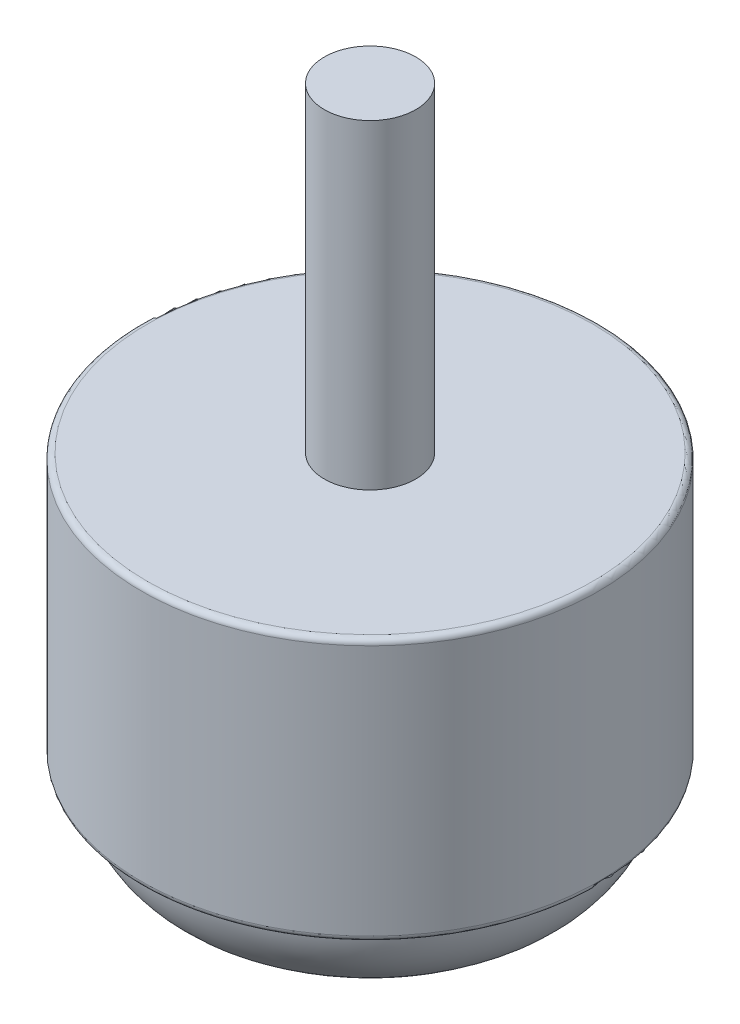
ISO-10303-21;
HEADER;
FILE_DESCRIPTION(('STEP AP214'),'2;1');
FILE_NAME('part.step','',(''),(''),'','','');
FILE_SCHEMA(('AUTOMOTIVE_DESIGN { 1 0 10303 214 1 1 1 1 }'));
ENDSEC;
DATA;
#1=APPLICATION_CONTEXT('core data for automotive mechanical design processes');
#2=APPLICATION_PROTOCOL_DEFINITION('international standard','automotive_design',2000,#1);
#3=PRODUCT_CONTEXT('',#1,'mechanical');
#4=PRODUCT('Part','Part','',(#3));
#5=PRODUCT_RELATED_PRODUCT_CATEGORY('part','',(#4));
#6=PRODUCT_DEFINITION_FORMATION('','',#4);
#7=PRODUCT_DEFINITION_CONTEXT('part definition',#1,'design');
#8=PRODUCT_DEFINITION('design','',#6,#7);
#9=PRODUCT_DEFINITION_SHAPE('','',#8);
#10=(LENGTH_UNIT() NAMED_UNIT(*) SI_UNIT(.MILLI.,.METRE.));
#11=(NAMED_UNIT(*) PLANE_ANGLE_UNIT() SI_UNIT($,.RADIAN.));
#12=(NAMED_UNIT(*) SI_UNIT($,.STERADIAN.) SOLID_ANGLE_UNIT());
#13=UNCERTAINTY_MEASURE_WITH_UNIT(LENGTH_MEASURE(1.E-05),#10,'distance_accuracy_value','');
#14=(GEOMETRIC_REPRESENTATION_CONTEXT(3) GLOBAL_UNCERTAINTY_ASSIGNED_CONTEXT((#13)) GLOBAL_UNIT_ASSIGNED_CONTEXT((#10,
#11,#12)) REPRESENTATION_CONTEXT('',''));
#15=CARTESIAN_POINT('',(0.,0.,0.));
#16=DIRECTION('',(0.,0.,1.));
#17=DIRECTION('',(1.,0.,0.));
#18=AXIS2_PLACEMENT_3D('',#15,#16,#17);
#19=CARTESIAN_POINT('',(0.,12.,0.));
#20=DIRECTION('',(0.,-1.,0.));
#21=DIRECTION('',(0.,0.,-1.));
#22=AXIS2_PLACEMENT_3D('',#19,#20,#21);
#23=TOROIDAL_SURFACE('',#22,19.1745128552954,1.);
#24=CARTESIAN_POINT('',(0.,13.,0.));
#25=DIRECTION('',(0.,-1.,0.));
#26=DIRECTION('',(0.,0.,-1.));
#27=AXIS2_PLACEMENT_3D('',#24,#25,#26);
#28=CIRCLE('',#27,19.1745128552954);
#29=CARTESIAN_POINT('',(0.,13.,-19.1745128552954));
#30=VERTEX_POINT('',#29);
#31=EDGE_CURVE('E10',#30,#30,#28,.T.);
#32=ORIENTED_EDGE('',*,*,#31,.T.);
#33=EDGE_LOOP('',(#32));
#34=FACE_BOUND('',#33,.T.);
#35=CARTESIAN_POINT('',(0.,12.1123825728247,0.));
#36=DIRECTION('',(0.,-1.,0.));
#37=DIRECTION('',(0.,0.,-1.));
#38=AXIS2_PLACEMENT_3D('',#35,#36,#37);
#39=CIRCLE('',#38,18.1808478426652);
#40=CARTESIAN_POINT('',(0.,12.1123825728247,-18.1808478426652));
#41=VERTEX_POINT('',#40);
#42=EDGE_CURVE('E67',#41,#41,#39,.T.);
#43=ORIENTED_EDGE('',*,*,#42,.F.);
#44=EDGE_LOOP('',(#43));
#45=FACE_BOUND('',#44,.T.);
#46=ADVANCED_FACE('F30',(#34,#45),#23,.F.);
#47=CARTESIAN_POINT('',(19.5,13.,0.));
#48=DIRECTION('',(0.,-1.,0.));
#49=DIRECTION('',(0.,0.,-1.));
#50=AXIS2_PLACEMENT_3D('',#47,#48,#49);
#51=PLANE('',#50);
#52=CARTESIAN_POINT('',(0.,13.,0.));
#53=DIRECTION('',(0.,-1.,0.));
#54=DIRECTION('',(0.,0.,-1.));
#55=AXIS2_PLACEMENT_3D('',#52,#53,#54);
#56=CIRCLE('',#55,19.5);
#57=CARTESIAN_POINT('',(0.,13.,-19.5));
#58=VERTEX_POINT('',#57);
#59=EDGE_CURVE('E36',#58,#58,#56,.T.);
#60=ORIENTED_EDGE('',*,*,#59,.T.);
#61=EDGE_LOOP('',(#60));
#62=FACE_BOUND('',#61,.T.);
#63=ORIENTED_EDGE('',*,*,#31,.F.);
#64=EDGE_LOOP('',(#63));
#65=FACE_BOUND('',#64,.T.);
#66=ADVANCED_FACE('F75',(#62,#65),#51,.T.);
#67=CARTESIAN_POINT('',(0.,13.5,0.));
#68=DIRECTION('',(0.,-1.,0.));
#69=DIRECTION('',(0.,0.,-1.));
#70=AXIS2_PLACEMENT_3D('',#67,#68,#69);
#71=TOROIDAL_SURFACE('',#70,19.5,0.5);
#72=CARTESIAN_POINT('',(0.,13.5,0.));
#73=DIRECTION('',(0.,-1.,0.));
#74=DIRECTION('',(0.,0.,-1.));
#75=AXIS2_PLACEMENT_3D('',#72,#73,#74);
#76=CIRCLE('',#75,20.);
#77=CARTESIAN_POINT('',(0.,13.5,-20.));
#78=VERTEX_POINT('',#77);
#79=EDGE_CURVE('E40',#78,#78,#76,.T.);
#80=ORIENTED_EDGE('',*,*,#79,.T.);
#81=EDGE_LOOP('',(#80));
#82=FACE_BOUND('',#81,.T.);
#83=ORIENTED_EDGE('',*,*,#59,.F.);
#84=EDGE_LOOP('',(#83));
#85=FACE_BOUND('',#84,.T.);
#86=ADVANCED_FACE('F79',(#82,#85),#71,.T.);
#87=CARTESIAN_POINT('',(0.,0.,0.));
#88=DIRECTION('',(0.,-1.,0.));
#89=DIRECTION('',(0.,0.,-1.));
#90=AXIS2_PLACEMENT_3D('',#87,#88,#89);
#91=CYLINDRICAL_SURFACE('',#90,20.);
#92=CARTESIAN_POINT('',(0.,35.5,0.));
#93=DIRECTION('',(0.,-1.,0.));
#94=DIRECTION('',(0.,0.,-1.));
#95=AXIS2_PLACEMENT_3D('',#92,#93,#94);
#96=CIRCLE('',#95,20.);
#97=CARTESIAN_POINT('',(0.,35.5,-20.));
#98=VERTEX_POINT('',#97);
#99=EDGE_CURVE('E44',#98,#98,#96,.T.);
#100=ORIENTED_EDGE('',*,*,#99,.T.);
#101=EDGE_LOOP('',(#100));
#102=FACE_BOUND('',#101,.T.);
#103=ORIENTED_EDGE('',*,*,#79,.F.);
#104=EDGE_LOOP('',(#103));
#105=FACE_BOUND('',#104,.T.);
#106=ADVANCED_FACE('F83',(#102,#105),#91,.T.);
#107=CARTESIAN_POINT('',(0.,35.5,0.));
#108=DIRECTION('',(0.,-1.,0.));
#109=DIRECTION('',(0.,0.,-1.));
#110=AXIS2_PLACEMENT_3D('',#107,#108,#109);
#111=TOROIDAL_SURFACE('',#110,19.5,0.5);
#112=CARTESIAN_POINT('',(0.,36.,0.));
#113=DIRECTION('',(0.,-1.,0.));
#114=DIRECTION('',(0.,0.,-1.));
#115=AXIS2_PLACEMENT_3D('',#112,#113,#114);
#116=CIRCLE('',#115,19.5);
#117=CARTESIAN_POINT('',(0.,36.,-19.5));
#118=VERTEX_POINT('',#117);
#119=EDGE_CURVE('E49',#118,#118,#116,.T.);
#120=ORIENTED_EDGE('',*,*,#119,.T.);
#121=EDGE_LOOP('',(#120));
#122=FACE_BOUND('',#121,.T.);
#123=ORIENTED_EDGE('',*,*,#99,.F.);
#124=EDGE_LOOP('',(#123));
#125=FACE_BOUND('',#124,.T.);
#126=ADVANCED_FACE('F90',(#122,#125),#111,.T.);
#127=CARTESIAN_POINT('',(4.,36.,0.));
#128=DIRECTION('',(0.,1.,0.));
#129=DIRECTION('',(0.,0.,1.));
#130=AXIS2_PLACEMENT_3D('',#127,#128,#129);
#131=PLANE('',#130);
#132=CARTESIAN_POINT('',(0.,36.,0.));
#133=DIRECTION('',(0.,-1.,0.));
#134=DIRECTION('',(0.,0.,-1.));
#135=AXIS2_PLACEMENT_3D('',#132,#133,#134);
#136=CIRCLE('',#135,4.);
#137=CARTESIAN_POINT('',(0.,36.,-4.));
#138=VERTEX_POINT('',#137);
#139=EDGE_CURVE('E52',#138,#138,#136,.T.);
#140=ORIENTED_EDGE('',*,*,#139,.T.);
#141=EDGE_LOOP('',(#140));
#142=FACE_BOUND('',#141,.T.);
#143=ORIENTED_EDGE('',*,*,#119,.F.);
#144=EDGE_LOOP('',(#143));
#145=FACE_BOUND('',#144,.T.);
#146=ADVANCED_FACE('F94',(#142,#145),#131,.T.);
#147=CARTESIAN_POINT('',(0.,0.,0.));
#148=DIRECTION('',(0.,-1.,0.));
#149=DIRECTION('',(0.,0.,-1.));
#150=AXIS2_PLACEMENT_3D('',#147,#148,#149);
#151=CYLINDRICAL_SURFACE('',#150,4.);
#152=CARTESIAN_POINT('',(0.,64.,0.));
#153=DIRECTION('',(0.,-1.,0.));
#154=DIRECTION('',(0.,0.,-1.));
#155=AXIS2_PLACEMENT_3D('',#152,#153,#154);
#156=CIRCLE('',#155,4.);
#157=CARTESIAN_POINT('',(0.,64.,-4.));
#158=VERTEX_POINT('',#157);
#159=EDGE_CURVE('E55',#158,#158,#156,.T.);
#160=ORIENTED_EDGE('',*,*,#159,.T.);
#161=EDGE_LOOP('',(#160));
#162=FACE_BOUND('',#161,.T.);
#163=ORIENTED_EDGE('',*,*,#139,.F.);
#164=EDGE_LOOP('',(#163));
#165=FACE_BOUND('',#164,.T.);
#166=ADVANCED_FACE('F98',(#162,#165),#151,.T.);
#167=CARTESIAN_POINT('',(0.,64.,0.));
#168=DIRECTION('',(0.,1.,0.));
#169=DIRECTION('',(0.,0.,1.));
#170=AXIS2_PLACEMENT_3D('',#167,#168,#169);
#171=PLANE('',#170);
#172=ORIENTED_EDGE('',*,*,#159,.F.);
#173=EDGE_LOOP('',(#172));
#174=FACE_BOUND('',#173,.T.);
#175=ADVANCED_FACE('F102',(#174),#171,.T.);
#176=CARTESIAN_POINT('',(0.,12.5,0.));
#177=DIRECTION('',(0.,-1.,0.));
#178=DIRECTION('',(-1.,0.,0.));
#179=AXIS2_PLACEMENT_3D('',#176,#177,#178);
#180=SPHERICAL_SURFACE('',#179,12.5);
#181=CARTESIAN_POINT('',(0.,6.,0.));
#182=DIRECTION('',(0.,-1.,0.));
#183=DIRECTION('',(0.,0.,-1.));
#184=AXIS2_PLACEMENT_3D('',#181,#182,#183);
#185=CIRCLE('',#184,10.6770782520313);
#186=CARTESIAN_POINT('',(0.,6.,-10.6770782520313));
#187=VERTEX_POINT('',#186);
#188=EDGE_CURVE('E58',#187,#187,#185,.T.);
#189=ORIENTED_EDGE('',*,*,#188,.T.);
#190=EDGE_LOOP('',(#189));
#191=FACE_BOUND('',#190,.T.);
#192=ADVANCED_FACE('F106',(#191),#180,.T.);
#193=CARTESIAN_POINT('',(13.4231056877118,6.,0.));
#194=DIRECTION('',(0.,-1.,0.));
#195=DIRECTION('',(0.,0.,-1.));
#196=AXIS2_PLACEMENT_3D('',#193,#194,#195);
#197=PLANE('',#196);
#198=CARTESIAN_POINT('',(0.,6.,0.));
#199=DIRECTION('',(0.,-1.,0.));
#200=DIRECTION('',(0.,0.,-1.));
#201=AXIS2_PLACEMENT_3D('',#198,#199,#200);
#202=CIRCLE('',#201,13.4231056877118);
#203=CARTESIAN_POINT('',(0.,6.,-13.4231056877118));
#204=VERTEX_POINT('',#203);
#205=EDGE_CURVE('E61',#204,#204,#202,.T.);
#206=ORIENTED_EDGE('',*,*,#205,.T.);
#207=EDGE_LOOP('',(#206));
#208=FACE_BOUND('',#207,.T.);
#209=ORIENTED_EDGE('',*,*,#188,.F.);
#210=EDGE_LOOP('',(#209));
#211=FACE_BOUND('',#210,.T.);
#212=ADVANCED_FACE('F110',(#208,#211),#197,.T.);
#213=CARTESIAN_POINT('',(0.,6.5,0.));
#214=DIRECTION('',(0.,-1.,0.));
#215=DIRECTION('',(0.,0.,-1.));
#216=AXIS2_PLACEMENT_3D('',#213,#214,#215);
#217=TOROIDAL_SURFACE('',#216,13.4231056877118,0.499999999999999);
#218=CARTESIAN_POINT('',(0.,6.03836250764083,0.));
#219=DIRECTION('',(0.,-1.,0.));
#220=DIRECTION('',(0.,0.,-1.));
#221=AXIS2_PLACEMENT_3D('',#218,#219,#220);
#222=CIRCLE('',#221,13.6151755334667);
#223=CARTESIAN_POINT('',(0.,6.03836250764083,-13.6151755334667));
#224=VERTEX_POINT('',#223);
#225=EDGE_CURVE('E64',#224,#224,#222,.T.);
#226=ORIENTED_EDGE('',*,*,#225,.T.);
#227=EDGE_LOOP('',(#226));
#228=FACE_BOUND('',#227,.T.);
#229=ORIENTED_EDGE('',*,*,#205,.F.);
#230=EDGE_LOOP('',(#229));
#231=FACE_BOUND('',#230,.T.);
#232=ADVANCED_FACE('F114',(#228,#231),#217,.T.);
#233=CARTESIAN_POINT('',(0.,12.954188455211,0.));
#234=DIRECTION('',(0.,-1.,0.));
#235=DIRECTION('',(0.,0.,-1.));
#236=AXIS2_PLACEMENT_3D('',#233,#234,#235);
#237=TOROIDAL_SURFACE('',#236,10.737762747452,7.49053755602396);
#238=ORIENTED_EDGE('',*,*,#42,.T.);
#239=EDGE_LOOP('',(#238));
#240=FACE_BOUND('',#239,.T.);
#241=ORIENTED_EDGE('',*,*,#225,.F.);
#242=EDGE_LOOP('',(#241));
#243=FACE_BOUND('',#242,.T.);
#244=ADVANCED_FACE('F71',(#240,#243),#237,.T.);
#245=CLOSED_SHELL('',(#46,#66,#86,#106,#126,#146,#166,#175,#192,#212,#232,#244));
#246=MANIFOLD_SOLID_BREP('B2',#245);
#247=ADVANCED_BREP_SHAPE_REPRESENTATION('',(#18,#246),#14);
#248=SHAPE_DEFINITION_REPRESENTATION(#9,#247);
ENDSEC;
END-ISO-10303-21;
